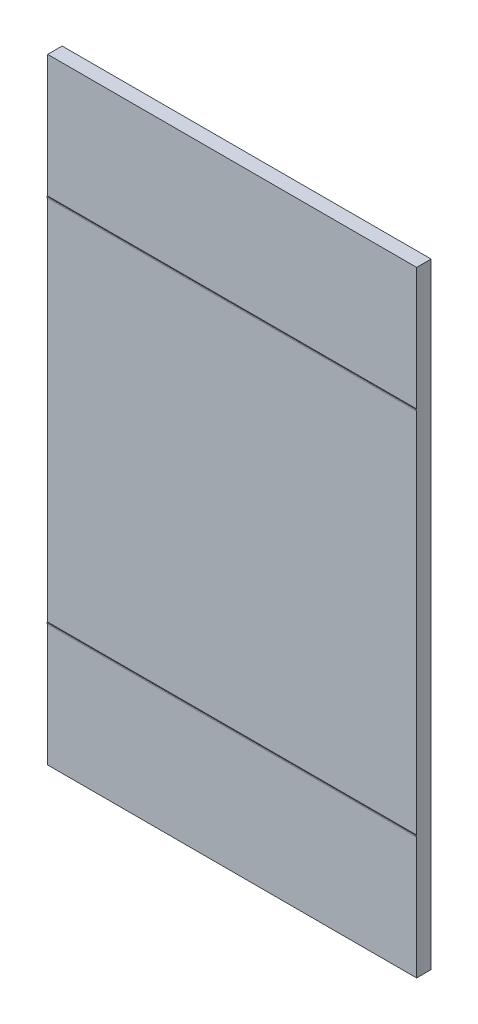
from build123d import *

# Parameters (mm, degrees)
SKETCH1_W                = 1275.08
SKETCH1_H                = 764.54
BOSS_EXTRUDE1_DEPTH      = 29.972
BOSS_EXTRUDE2_DEPTH      = 382.27
BOSS_EXTRUDE2_DEPTH_BACK = 382.27
SKETCH2_W                = 2.54
SKETCH2_H                = 1.5875


with BuildPart() as part:
    # Sketch1 → Boss-Extrude1 (new body)
    with BuildSketch(Plane(origin=(0, 0, 0), x_dir=(0, 1, 0), z_dir=(0, 0, 1))):
        Rectangle(SKETCH1_W, SKETCH1_H)
    extrude(amount=BOSS_EXTRUDE1_DEPTH)

    # Sketch2 → Boss-Extrude2 (add, two sides: drawn at the far end of the back side and taken through both)
    with BuildSketch(Plane.YZ.offset(-BOSS_EXTRUDE2_DEPTH_BACK)):
        with Locations((-382.27, 30.76575)):
            Rectangle(SKETCH2_W, SKETCH2_H)
        with Locations((382.27, 30.76575)):
            Rectangle(SKETCH2_W, SKETCH2_H)
    extrude(amount=BOSS_EXTRUDE2_DEPTH + BOSS_EXTRUDE2_DEPTH_BACK)


solid = part.part
